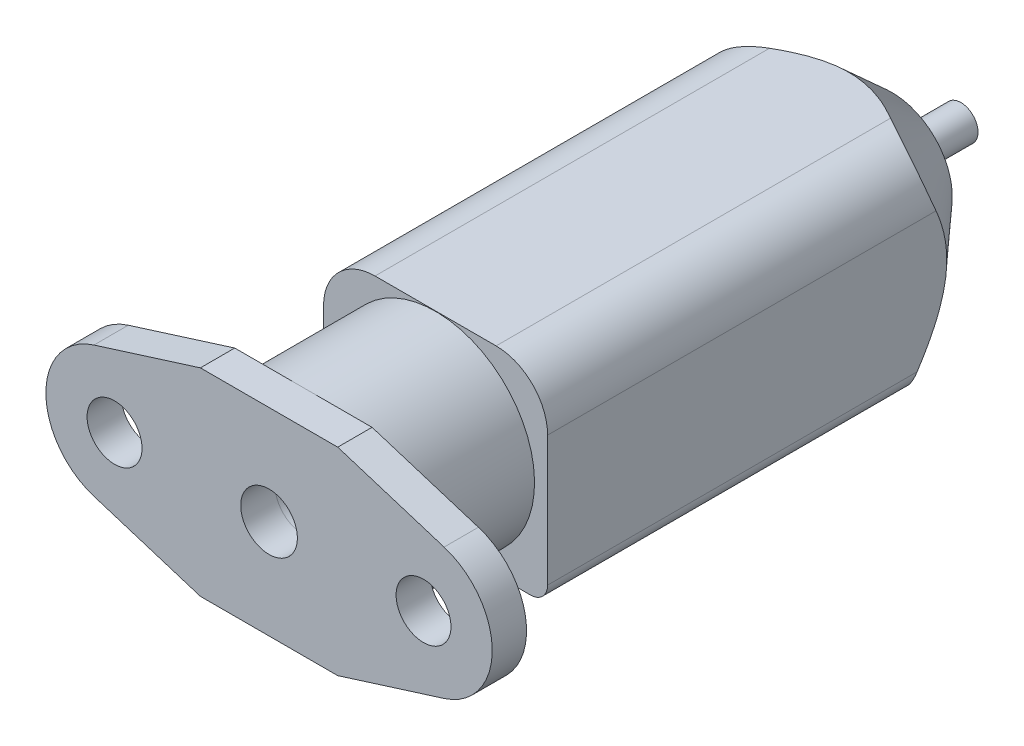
from build123d import *

# Parameters (mm, degrees)
CROQUIS1_R               = 1.598160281
CROQUIS1_R_2             = 1.600993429
CROQUIS1_R_3             = 1.650918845
SALIENTE_EXTRUIR7_DEPTH  = 2
CROQUIS2_R               = 5.764999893
CROQUIS2_R_2             = 1.651186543
SALIENTE_EXTRUIR8_DEPTH  = 7.7
SALIENTE_EXTRUIR9_DEPTH  = 26.6
CROQUIS6_R               = 0.999415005
SALIENTE_EXTRUIR10_DEPTH = 4


with BuildPart() as part:
    # Croquis1 → Saliente-Extruir7 (new body)
    with BuildSketch(Plane.XY):
        with BuildLine():
            Line((4.00000019, 5.763000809), (10.195969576, 3.8191034))
            ThreePointArc((10.195969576, 3.8191034), (12.999977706, 0.001566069), (10.197782, -3.817301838))
            Line((10.197782, -3.817301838), (4.00000019, -5.764999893))
            Line((4.00000019, -5.764999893), (-4.00000019, -5.764999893))
            Line((-4.00000019, -5.764999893), (-10.199065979, -3.817665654))
            ThreePointArc((-10.199065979, -3.817665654), (-13.000622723, -0.001109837), (-10.199143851, 3.815503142))
            Line((-10.199143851, 3.815503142), (-4.00000019, 5.763000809))
            Line((-4.00000019, 5.763000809), (4.00000019, 5.763000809))
        make_face()
        with Locations((8.997973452, 0.000616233)):
            Circle(CROQUIS1_R, mode=Mode.SUBTRACT)
        with Locations((-9.000145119, -0.001069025)):
            Circle(CROQUIS1_R_2, mode=Mode.SUBTRACT)
        Circle(CROQUIS1_R_3, mode=Mode.SUBTRACT)
    extrude(amount=-SALIENTE_EXTRUIR7_DEPTH)

    # Croquis2 → Saliente-Extruir8 (add)
    with BuildSketch(Plane(origin=(0, 0, -2), x_dir=(-1, 0, 0), z_dir=(0, 0, -1))):
        with Locations(Location((0, 0, 0), (0, 0, 91.508919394))):
            Circle(CROQUIS2_R)
        with Locations(Location((0, 0, 0), (0, 0, 180))):
            Circle(CROQUIS2_R_2, mode=Mode.SUBTRACT)
    extrude(amount=SALIENTE_EXTRUIR8_DEPTH)

    # Croquis3 → Saliente-Extruir9 (add)
    with BuildSketch(Plane(origin=(0, 0, -9.7), x_dir=(-1, 0, 0), z_dir=(0, 0, -1))):
        with BuildLine():
            Line((3.526868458, 5.783774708), (-3.526868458, 5.783774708))
            ThreePointArc((-3.526868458, 5.783774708), (-5.648188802, 4.905095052), (-6.526868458, 2.783774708))
            Line((-6.526868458, 2.783774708), (-6.526868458, -4.783774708))
            ThreePointArc((-6.526868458, -4.783774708), (-6.233975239, -5.490881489), (-5.526868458, -5.783774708))
            Line((-5.526868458, -5.783774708), (5.526868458, -5.783774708))
            ThreePointArc((5.526868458, -5.783774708), (6.233975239, -5.490881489), (6.526868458, -4.783774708))
            Line((6.526868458, -4.783774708), (6.526868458, 2.783774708))
            ThreePointArc((6.526868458, 2.783774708), (5.648188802, 4.905095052), (3.526868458, 5.783774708))
        make_face()
    extrude(amount=SALIENTE_EXTRUIR9_DEPTH)

    # Croquis5 → Cortar-Revoluci_n1 (revolve, cut)
    with BuildSketch(Plane(origin=(0, 0, 0), x_dir=(1, 0, 0), z_dir=(0, 1, 0)), mode=Mode.PRIVATE) as cortar_revoluci_n1_sk:
        Polygon((-3.5, 36.3), (-8.472559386, 30.803521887), (-8.472559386, 36.3), align=None)
    revolve(cortar_revoluci_n1_sk.sketch.rotate(Axis((0, 0, -44.835), (0, 0, 1)), 203.098732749), axis=Axis((0, 0, -44.835), (0, 0, 1)), mode=Mode.SUBTRACT)

    # Croquis6 → Saliente-Extruir10 (add)
    with BuildSketch(Plane(origin=(0, 0, -36.3), x_dir=(-1, 0, 0), z_dir=(0, 0, -1))):
        Circle(CROQUIS6_R)
    extrude(amount=SALIENTE_EXTRUIR10_DEPTH)


solid = part.part
